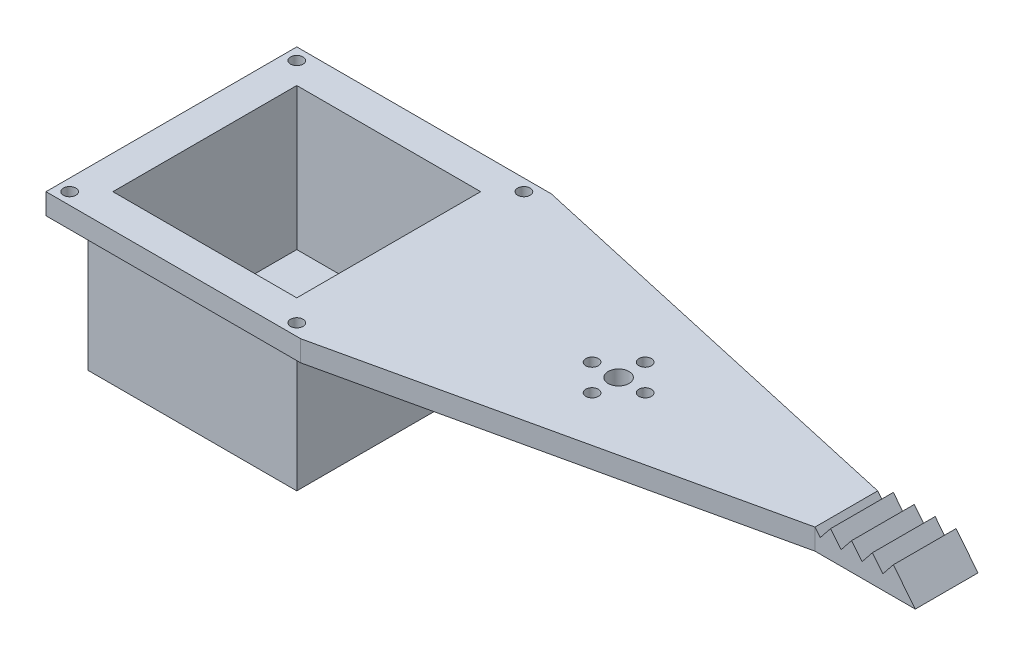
ISO-10303-21;
HEADER;
FILE_DESCRIPTION(('STEP AP214'),'2;1');
FILE_NAME('part.step','',(''),(''),'','','');
FILE_SCHEMA(('AUTOMOTIVE_DESIGN { 1 0 10303 214 1 1 1 1 }'));
ENDSEC;
DATA;
#1=APPLICATION_CONTEXT('core data for automotive mechanical design processes');
#2=APPLICATION_PROTOCOL_DEFINITION('international standard','automotive_design',2000,#1);
#3=PRODUCT_CONTEXT('',#1,'mechanical');
#4=PRODUCT('Part','Part','',(#3));
#5=PRODUCT_RELATED_PRODUCT_CATEGORY('part','',(#4));
#6=PRODUCT_DEFINITION_FORMATION('','',#4);
#7=PRODUCT_DEFINITION_CONTEXT('part definition',#1,'design');
#8=PRODUCT_DEFINITION('design','',#6,#7);
#9=PRODUCT_DEFINITION_SHAPE('','',#8);
#10=(LENGTH_UNIT() NAMED_UNIT(*) SI_UNIT(.MILLI.,.METRE.));
#11=(NAMED_UNIT(*) PLANE_ANGLE_UNIT() SI_UNIT($,.RADIAN.));
#12=(NAMED_UNIT(*) SI_UNIT($,.STERADIAN.) SOLID_ANGLE_UNIT());
#13=UNCERTAINTY_MEASURE_WITH_UNIT(LENGTH_MEASURE(1.E-05),#10,'distance_accuracy_value','');
#14=(GEOMETRIC_REPRESENTATION_CONTEXT(3) GLOBAL_UNCERTAINTY_ASSIGNED_CONTEXT((#13)) GLOBAL_UNIT_ASSIGNED_CONTEXT((#10,
#11,#12)) REPRESENTATION_CONTEXT('',''));
#15=CARTESIAN_POINT('',(0.,0.,0.));
#16=DIRECTION('',(0.,0.,1.));
#17=DIRECTION('',(1.,0.,0.));
#18=AXIS2_PLACEMENT_3D('',#15,#16,#17);
#19=CARTESIAN_POINT('',(157.736236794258,35.4387505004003,-55.01));
#20=DIRECTION('',(0.780624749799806,0.624999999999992,0.));
#21=DIRECTION('',(-0.624999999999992,0.780624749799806,0.));
#22=AXIS2_PLACEMENT_3D('',#19,#20,#21);
#23=PLANE('',#22);
#24=DIRECTION('',(0.624999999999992,-0.780624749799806,0.));
#25=VECTOR('',#24,1.);
#26=CARTESIAN_POINT('',(228.852940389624,-53.3859838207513,-32.5));
#27=LINE('',#26,#25);
#28=CARTESIAN_POINT('',(156.486236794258,37.,-32.4999999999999));
#29=VERTEX_POINT('',#28);
#30=CARTESIAN_POINT('',(157.736236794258,35.4387505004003,-32.4999999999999));
#31=VERTEX_POINT('',#30);
#32=EDGE_CURVE('E221',#29,#31,#27,.T.);
#33=ORIENTED_EDGE('',*,*,#32,.F.);
#34=DIRECTION('',(0.,0.,1.));
#35=VECTOR('',#34,1.);
#36=CARTESIAN_POINT('',(156.486236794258,37.,-32.4999999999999));
#37=LINE('',#36,#35);
#38=CARTESIAN_POINT('',(156.486236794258,37.,-17.5));
#39=VERTEX_POINT('',#38);
#40=EDGE_CURVE('E41',#29,#39,#37,.T.);
#41=ORIENTED_EDGE('',*,*,#40,.T.);
#42=DIRECTION('',(-0.624999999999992,0.780624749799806,0.));
#43=VECTOR('',#42,1.);
#44=CARTESIAN_POINT('',(228.852940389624,-53.3859838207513,-17.5));
#45=LINE('',#44,#43);
#46=CARTESIAN_POINT('',(157.736236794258,35.4387505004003,-17.5));
#47=VERTEX_POINT('',#46);
#48=EDGE_CURVE('E212',#47,#39,#45,.T.);
#49=ORIENTED_EDGE('',*,*,#48,.F.);
#50=DIRECTION('',(0.,0.,1.));
#51=VECTOR('',#50,1.);
#52=CARTESIAN_POINT('',(157.736236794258,35.4387505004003,-55.01));
#53=LINE('',#52,#51);
#54=EDGE_CURVE('E11',#31,#47,#53,.T.);
#55=ORIENTED_EDGE('',*,*,#54,.F.);
#56=EDGE_LOOP('',(#33,#41,#49,#55));
#57=FACE_BOUND('',#56,.T.);
#58=ADVANCED_FACE('F37',(#57),#23,.T.);
#59=CARTESIAN_POINT('',(158.986236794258,36.9999999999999,-55.01));
#60=DIRECTION('',(-0.780624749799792,0.625000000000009,0.));
#61=DIRECTION('',(-0.625000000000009,-0.780624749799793,0.));
#62=AXIS2_PLACEMENT_3D('',#59,#60,#61);
#63=PLANE('',#62);
#64=DIRECTION('',(0.625000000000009,0.780624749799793,0.));
#65=VECTOR('',#64,1.);
#66=CARTESIAN_POINT('',(225.497473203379,120.07250764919,-32.5));
#67=LINE('',#66,#65);
#68=CARTESIAN_POINT('',(160.236236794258,38.5612494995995,-32.4999999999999));
#69=VERTEX_POINT('',#68);
#70=EDGE_CURVE('E279',#31,#69,#67,.T.);
#71=ORIENTED_EDGE('',*,*,#70,.F.);
#72=ORIENTED_EDGE('',*,*,#54,.T.);
#73=DIRECTION('',(-0.625000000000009,-0.780624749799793,0.));
#74=VECTOR('',#73,1.);
#75=CARTESIAN_POINT('',(225.497473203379,120.07250764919,-17.5));
#76=LINE('',#75,#74);
#77=CARTESIAN_POINT('',(160.236236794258,38.5612494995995,-17.5));
#78=VERTEX_POINT('',#77);
#79=EDGE_CURVE('E215',#78,#47,#76,.T.);
#80=ORIENTED_EDGE('',*,*,#79,.F.);
#81=DIRECTION('',(0.,0.,1.));
#82=VECTOR('',#81,1.);
#83=CARTESIAN_POINT('',(160.236236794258,38.5612494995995,-55.01));
#84=LINE('',#83,#82);
#85=EDGE_CURVE('E47',#69,#78,#84,.T.);
#86=ORIENTED_EDGE('',*,*,#85,.F.);
#87=EDGE_LOOP('',(#71,#72,#80,#86));
#88=FACE_BOUND('',#87,.T.);
#89=ADVANCED_FACE('F326',(#88),#63,.T.);
#90=CARTESIAN_POINT('',(161.486236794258,36.9999999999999,-55.01));
#91=DIRECTION('',(0.780624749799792,0.625000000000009,0.));
#92=DIRECTION('',(-0.625000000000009,0.780624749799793,0.));
#93=AXIS2_PLACEMENT_3D('',#90,#91,#92);
#94=PLANE('',#93);
#95=DIRECTION('',(0.625000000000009,-0.780624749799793,0.));
#96=VECTOR('',#95,1.);
#97=CARTESIAN_POINT('',(231.899815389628,-50.9465314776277,-32.5));
#98=LINE('',#97,#96);
#99=CARTESIAN_POINT('',(162.736236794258,35.4387505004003,-32.4999999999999));
#100=VERTEX_POINT('',#99);
#101=EDGE_CURVE('E282',#69,#100,#98,.T.);
#102=ORIENTED_EDGE('',*,*,#101,.F.);
#103=ORIENTED_EDGE('',*,*,#85,.T.);
#104=DIRECTION('',(-0.625000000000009,0.780624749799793,0.));
#105=VECTOR('',#104,1.);
#106=CARTESIAN_POINT('',(231.899815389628,-50.9465314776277,-17.5));
#107=LINE('',#106,#105);
#108=CARTESIAN_POINT('',(162.736236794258,35.4387505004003,-17.5));
#109=VERTEX_POINT('',#108);
#110=EDGE_CURVE('E259',#109,#78,#107,.T.);
#111=ORIENTED_EDGE('',*,*,#110,.F.);
#112=DIRECTION('',(0.,0.,1.));
#113=VECTOR('',#112,1.);
#114=CARTESIAN_POINT('',(162.736236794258,35.4387505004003,-55.01));
#115=LINE('',#114,#113);
#116=EDGE_CURVE('E247',#100,#109,#115,.T.);
#117=ORIENTED_EDGE('',*,*,#116,.F.);
#118=EDGE_LOOP('',(#102,#103,#111,#117));
#119=FACE_BOUND('',#118,.T.);
#120=ADVANCED_FACE('F323',(#119),#94,.T.);
#121=CARTESIAN_POINT('',(163.986236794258,36.9999999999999,-55.01));
#122=DIRECTION('',(-0.780624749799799,0.625000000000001,0.));
#123=DIRECTION('',(-0.625000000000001,-0.780624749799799,0.));
#124=AXIS2_PLACEMENT_3D('',#121,#122,#123);
#125=PLANE('',#124);
#126=DIRECTION('',(0.625000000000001,0.780624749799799,0.));
#127=VECTOR('',#126,1.);
#128=CARTESIAN_POINT('',(228.544348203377,117.633055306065,-32.5));
#129=LINE('',#128,#127);
#130=CARTESIAN_POINT('',(165.236236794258,38.5612494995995,-32.4999999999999));
#131=VERTEX_POINT('',#130);
#132=EDGE_CURVE('E285',#100,#131,#129,.T.);
#133=ORIENTED_EDGE('',*,*,#132,.F.);
#134=ORIENTED_EDGE('',*,*,#116,.T.);
#135=DIRECTION('',(-0.625000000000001,-0.780624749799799,0.));
#136=VECTOR('',#135,1.);
#137=CARTESIAN_POINT('',(228.544348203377,117.633055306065,-17.5));
#138=LINE('',#137,#136);
#139=CARTESIAN_POINT('',(165.236236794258,38.5612494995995,-17.5));
#140=VERTEX_POINT('',#139);
#141=EDGE_CURVE('E261',#140,#109,#138,.T.);
#142=ORIENTED_EDGE('',*,*,#141,.F.);
#143=DIRECTION('',(0.,0.,1.));
#144=VECTOR('',#143,1.);
#145=CARTESIAN_POINT('',(165.236236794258,38.5612494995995,-55.01));
#146=LINE('',#145,#144);
#147=EDGE_CURVE('E249',#131,#140,#146,.T.);
#148=ORIENTED_EDGE('',*,*,#147,.F.);
#149=EDGE_LOOP('',(#133,#134,#142,#148));
#150=FACE_BOUND('',#149,.T.);
#151=ADVANCED_FACE('F320',(#150),#125,.T.);
#152=CARTESIAN_POINT('',(166.486236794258,37.,-55.01));
#153=DIRECTION('',(0.780624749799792,0.625000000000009,0.));
#154=DIRECTION('',(-0.625000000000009,0.780624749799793,0.));
#155=AXIS2_PLACEMENT_3D('',#152,#153,#154);
#156=PLANE('',#155);
#157=DIRECTION('',(0.625000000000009,-0.780624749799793,0.));
#158=VECTOR('',#157,1.);
#159=CARTESIAN_POINT('',(234.946690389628,-48.5070791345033,-32.5));
#160=LINE('',#159,#158);
#161=CARTESIAN_POINT('',(167.736236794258,35.4387505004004,-32.4999999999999));
#162=VERTEX_POINT('',#161);
#163=EDGE_CURVE('E288',#131,#162,#160,.T.);
#164=ORIENTED_EDGE('',*,*,#163,.F.);
#165=ORIENTED_EDGE('',*,*,#147,.T.);
#166=DIRECTION('',(-0.625000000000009,0.780624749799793,0.));
#167=VECTOR('',#166,1.);
#168=CARTESIAN_POINT('',(234.946690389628,-48.5070791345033,-17.5));
#169=LINE('',#168,#167);
#170=CARTESIAN_POINT('',(167.736236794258,35.4387505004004,-17.5));
#171=VERTEX_POINT('',#170);
#172=EDGE_CURVE('E264',#171,#140,#169,.T.);
#173=ORIENTED_EDGE('',*,*,#172,.F.);
#174=DIRECTION('',(0.,0.,1.));
#175=VECTOR('',#174,1.);
#176=CARTESIAN_POINT('',(167.736236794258,35.4387505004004,-55.01));
#177=LINE('',#176,#175);
#178=EDGE_CURVE('E251',#162,#171,#177,.T.);
#179=ORIENTED_EDGE('',*,*,#178,.F.);
#180=EDGE_LOOP('',(#164,#165,#173,#179));
#181=FACE_BOUND('',#180,.T.);
#182=ADVANCED_FACE('F315',(#181),#156,.T.);
#183=CARTESIAN_POINT('',(168.986236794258,37.,-55.01));
#184=DIRECTION('',(-0.780624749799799,0.625000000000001,0.));
#185=DIRECTION('',(-0.625000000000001,-0.780624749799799,0.));
#186=AXIS2_PLACEMENT_3D('',#183,#184,#185);
#187=PLANE('',#186);
#188=DIRECTION('',(0.625000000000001,0.780624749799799,0.));
#189=VECTOR('',#188,1.);
#190=CARTESIAN_POINT('',(231.591223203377,115.193602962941,-32.5));
#191=LINE('',#190,#189);
#192=CARTESIAN_POINT('',(170.236236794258,38.5612494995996,-32.4999999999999));
#193=VERTEX_POINT('',#192);
#194=EDGE_CURVE('E291',#162,#193,#191,.T.);
#195=ORIENTED_EDGE('',*,*,#194,.F.);
#196=ORIENTED_EDGE('',*,*,#178,.T.);
#197=DIRECTION('',(-0.625000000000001,-0.780624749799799,0.));
#198=VECTOR('',#197,1.);
#199=CARTESIAN_POINT('',(231.591223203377,115.193602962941,-17.5));
#200=LINE('',#199,#198);
#201=CARTESIAN_POINT('',(170.236236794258,38.5612494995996,-17.5));
#202=VERTEX_POINT('',#201);
#203=EDGE_CURVE('E267',#202,#171,#200,.T.);
#204=ORIENTED_EDGE('',*,*,#203,.F.);
#205=DIRECTION('',(0.,0.,1.));
#206=VECTOR('',#205,1.);
#207=CARTESIAN_POINT('',(170.236236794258,38.5612494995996,-55.01));
#208=LINE('',#207,#206);
#209=EDGE_CURVE('E253',#193,#202,#208,.T.);
#210=ORIENTED_EDGE('',*,*,#209,.F.);
#211=EDGE_LOOP('',(#195,#196,#204,#210));
#212=FACE_BOUND('',#211,.T.);
#213=ADVANCED_FACE('F311',(#212),#187,.T.);
#214=CARTESIAN_POINT('',(171.486236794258,37.,-55.01));
#215=DIRECTION('',(0.780624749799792,0.625000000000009,0.));
#216=DIRECTION('',(-0.625000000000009,0.780624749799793,0.));
#217=AXIS2_PLACEMENT_3D('',#214,#215,#216);
#218=PLANE('',#217);
#219=DIRECTION('',(0.625000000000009,-0.780624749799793,0.));
#220=VECTOR('',#219,1.);
#221=CARTESIAN_POINT('',(237.993565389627,-46.0676267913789,-32.5));
#222=LINE('',#221,#220);
#223=CARTESIAN_POINT('',(172.736236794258,35.4387505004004,-32.4999999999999));
#224=VERTEX_POINT('',#223);
#225=EDGE_CURVE('E294',#193,#224,#222,.T.);
#226=ORIENTED_EDGE('',*,*,#225,.F.);
#227=ORIENTED_EDGE('',*,*,#209,.T.);
#228=DIRECTION('',(-0.625000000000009,0.780624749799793,0.));
#229=VECTOR('',#228,1.);
#230=CARTESIAN_POINT('',(237.993565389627,-46.0676267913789,-17.5));
#231=LINE('',#230,#229);
#232=CARTESIAN_POINT('',(172.736236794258,35.4387505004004,-17.5));
#233=VERTEX_POINT('',#232);
#234=EDGE_CURVE('E270',#233,#202,#231,.T.);
#235=ORIENTED_EDGE('',*,*,#234,.F.);
#236=DIRECTION('',(0.,0.,1.));
#237=VECTOR('',#236,1.);
#238=CARTESIAN_POINT('',(172.736236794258,35.4387505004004,-55.01));
#239=LINE('',#238,#237);
#240=EDGE_CURVE('E255',#224,#233,#239,.T.);
#241=ORIENTED_EDGE('',*,*,#240,.F.);
#242=EDGE_LOOP('',(#226,#227,#235,#241));
#243=FACE_BOUND('',#242,.T.);
#244=ADVANCED_FACE('F308',(#243),#218,.T.);
#245=CARTESIAN_POINT('',(173.986236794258,37.,-55.01));
#246=DIRECTION('',(-0.780624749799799,0.625000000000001,0.));
#247=DIRECTION('',(-0.625000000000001,-0.780624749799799,0.));
#248=AXIS2_PLACEMENT_3D('',#245,#246,#247);
#249=PLANE('',#248);
#250=DIRECTION('',(0.625000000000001,0.780624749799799,0.));
#251=VECTOR('',#250,1.);
#252=CARTESIAN_POINT('',(234.638098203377,112.754150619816,-32.5));
#253=LINE('',#252,#251);
#254=CARTESIAN_POINT('',(175.236236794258,38.5612494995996,-32.4999999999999));
#255=VERTEX_POINT('',#254);
#256=EDGE_CURVE('E230',#224,#255,#253,.T.);
#257=ORIENTED_EDGE('',*,*,#256,.F.);
#258=ORIENTED_EDGE('',*,*,#240,.T.);
#259=DIRECTION('',(-0.625000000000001,-0.780624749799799,0.));
#260=VECTOR('',#259,1.);
#261=CARTESIAN_POINT('',(234.638098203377,112.754150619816,-17.5));
#262=LINE('',#261,#260);
#263=CARTESIAN_POINT('',(175.236236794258,38.5612494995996,-17.5));
#264=VERTEX_POINT('',#263);
#265=EDGE_CURVE('E273',#264,#233,#262,.T.);
#266=ORIENTED_EDGE('',*,*,#265,.F.);
#267=DIRECTION('',(0.,0.,1.));
#268=VECTOR('',#267,1.);
#269=CARTESIAN_POINT('',(175.236236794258,38.5612494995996,-55.01));
#270=LINE('',#269,#268);
#271=EDGE_CURVE('E195',#255,#264,#270,.T.);
#272=ORIENTED_EDGE('',*,*,#271,.F.);
#273=EDGE_LOOP('',(#257,#258,#266,#272));
#274=FACE_BOUND('',#273,.T.);
#275=ADVANCED_FACE('F304',(#274),#249,.T.);
#276=CARTESIAN_POINT('',(176.486236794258,37.,-55.01));
#277=DIRECTION('',(0.780624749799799,0.625000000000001,0.));
#278=DIRECTION('',(-0.625000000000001,0.780624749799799,0.));
#279=AXIS2_PLACEMENT_3D('',#276,#277,#278);
#280=PLANE('',#279);
#281=DIRECTION('',(0.625000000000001,-0.780624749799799,0.));
#282=VECTOR('',#281,1.);
#283=CARTESIAN_POINT('',(241.040440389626,-43.6281744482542,-32.5));
#284=LINE('',#283,#282);
#285=CARTESIAN_POINT('',(180.489440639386,32.,-32.4999999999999));
#286=VERTEX_POINT('',#285);
#287=EDGE_CURVE('E224',#255,#286,#284,.T.);
#288=ORIENTED_EDGE('',*,*,#287,.F.);
#289=ORIENTED_EDGE('',*,*,#271,.T.);
#290=DIRECTION('',(-0.625000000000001,0.780624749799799,0.));
#291=VECTOR('',#290,1.);
#292=CARTESIAN_POINT('',(241.040440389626,-43.6281744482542,-17.5));
#293=LINE('',#292,#291);
#294=CARTESIAN_POINT('',(180.489440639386,32.,-17.5));
#295=VERTEX_POINT('',#294);
#296=EDGE_CURVE('E276',#295,#264,#293,.T.);
#297=ORIENTED_EDGE('',*,*,#296,.F.);
#298=DIRECTION('',(0.,0.,-1.));
#299=VECTOR('',#298,1.);
#300=CARTESIAN_POINT('',(180.489440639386,32.,0.));
#301=LINE('',#300,#299);
#302=EDGE_CURVE('E222',#295,#286,#301,.T.);
#303=ORIENTED_EDGE('',*,*,#302,.T.);
#304=EDGE_LOOP('',(#288,#289,#297,#303));
#305=FACE_BOUND('',#304,.T.);
#306=ADVANCED_FACE('F302',(#305),#280,.T.);
#307=CARTESIAN_POINT('',(0.,32.,0.));
#308=DIRECTION('',(0.,1.,0.));
#309=DIRECTION('',(0.,0.,1.));
#310=AXIS2_PLACEMENT_3D('',#307,#308,#309);
#311=PLANE('',#310);
#312=CARTESIAN_POINT('',(-2.17157287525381,32.,-52.1715728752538));
#313=DIRECTION('',(0.,1.,0.));
#314=DIRECTION('',(0.,0.,1.));
#315=AXIS2_PLACEMENT_3D('',#312,#313,#314);
#316=CIRCLE('',#315,1.5);
#317=CARTESIAN_POINT('',(-2.17157287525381,32.,-50.6715728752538));
#318=VERTEX_POINT('',#317);
#319=EDGE_CURVE('E341',#318,#318,#316,.F.);
#320=ORIENTED_EDGE('',*,*,#319,.F.);
#321=EDGE_LOOP('',(#320));
#322=FACE_BOUND('',#321,.T.);
#323=CARTESIAN_POINT('',(52.1715728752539,32.,-52.1715728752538));
#324=DIRECTION('',(0.,1.,0.));
#325=DIRECTION('',(0.,0.,1.));
#326=AXIS2_PLACEMENT_3D('',#323,#324,#325);
#327=CIRCLE('',#326,1.50000000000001);
#328=CARTESIAN_POINT('',(52.1715728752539,32.,-50.6715728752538));
#329=VERTEX_POINT('',#328);
#330=EDGE_CURVE('E360',#329,#329,#327,.F.);
#331=ORIENTED_EDGE('',*,*,#330,.F.);
#332=EDGE_LOOP('',(#331));
#333=FACE_BOUND('',#332,.T.);
#334=CARTESIAN_POINT('',(52.1715728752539,32.,2.17157287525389));
#335=DIRECTION('',(0.,1.,0.));
#336=DIRECTION('',(0.,0.,1.));
#337=AXIS2_PLACEMENT_3D('',#334,#335,#336);
#338=CIRCLE('',#337,1.5);
#339=CARTESIAN_POINT('',(52.1715728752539,32.,3.6715728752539));
#340=VERTEX_POINT('',#339);
#341=EDGE_CURVE('E368',#340,#340,#338,.F.);
#342=ORIENTED_EDGE('',*,*,#341,.F.);
#343=EDGE_LOOP('',(#342));
#344=FACE_BOUND('',#343,.T.);
#345=CARTESIAN_POINT('',(-2.17157287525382,32.,2.1715728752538));
#346=DIRECTION('',(0.,1.,0.));
#347=DIRECTION('',(0.,0.,1.));
#348=AXIS2_PLACEMENT_3D('',#345,#346,#347);
#349=CIRCLE('',#348,1.5);
#350=CARTESIAN_POINT('',(-2.17157287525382,32.,3.6715728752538));
#351=VERTEX_POINT('',#350);
#352=EDGE_CURVE('E361',#351,#351,#349,.F.);
#353=ORIENTED_EDGE('',*,*,#352,.F.);
#354=EDGE_LOOP('',(#353));
#355=FACE_BOUND('',#354,.T.);
#356=DIRECTION('',(0.,0.,-1.));
#357=VECTOR('',#356,1.);
#358=CARTESIAN_POINT('',(50.,32.,0.));
#359=LINE('',#358,#357);
#360=CARTESIAN_POINT('',(50.,32.,0.));
#361=VERTEX_POINT('',#360);
#362=CARTESIAN_POINT('',(50.,32.,-50.));
#363=VERTEX_POINT('',#362);
#364=EDGE_CURVE('E465',#361,#363,#359,.T.);
#365=ORIENTED_EDGE('',*,*,#364,.T.);
#366=DIRECTION('',(-1.,0.,0.));
#367=VECTOR('',#366,1.);
#368=CARTESIAN_POINT('',(0.,32.,-50.));
#369=LINE('',#368,#367);
#370=CARTESIAN_POINT('',(0.,32.,-50.));
#371=VERTEX_POINT('',#370);
#372=EDGE_CURVE('E467',#363,#371,#369,.T.);
#373=ORIENTED_EDGE('',*,*,#372,.T.);
#374=DIRECTION('',(0.,0.,1.));
#375=VECTOR('',#374,1.);
#376=CARTESIAN_POINT('',(0.,32.,0.));
#377=LINE('',#376,#375);
#378=CARTESIAN_POINT('',(0.,32.,0.));
#379=VERTEX_POINT('',#378);
#380=EDGE_CURVE('E452',#371,#379,#377,.T.);
#381=ORIENTED_EDGE('',*,*,#380,.T.);
#382=DIRECTION('',(1.,0.,0.));
#383=VECTOR('',#382,1.);
#384=CARTESIAN_POINT('',(0.,32.,0.));
#385=LINE('',#384,#383);
#386=EDGE_CURVE('E462',#379,#361,#385,.T.);
#387=ORIENTED_EDGE('',*,*,#386,.T.);
#388=EDGE_LOOP('',(#365,#373,#381,#387));
#389=FACE_BOUND('',#388,.T.);
#390=CARTESIAN_POINT('',(108.35,32.,-25.));
#391=DIRECTION('',(0.,1.,0.));
#392=DIRECTION('',(0.,0.,1.));
#393=AXIS2_PLACEMENT_3D('',#390,#391,#392);
#394=CIRCLE('',#393,1.5);
#395=CARTESIAN_POINT('',(108.35,32.,-23.5));
#396=VERTEX_POINT('',#395);
#397=EDGE_CURVE('E395',#396,#396,#394,.T.);
#398=ORIENTED_EDGE('',*,*,#397,.T.);
#399=EDGE_LOOP('',(#398));
#400=FACE_BOUND('',#399,.T.);
#401=CARTESIAN_POINT('',(102.,32.,-18.65));
#402=DIRECTION('',(0.,1.,0.));
#403=DIRECTION('',(0.,0.,1.));
#404=AXIS2_PLACEMENT_3D('',#401,#402,#403);
#405=CIRCLE('',#404,1.5);
#406=CARTESIAN_POINT('',(102.,32.,-17.15));
#407=VERTEX_POINT('',#406);
#408=EDGE_CURVE('E399',#407,#407,#405,.T.);
#409=ORIENTED_EDGE('',*,*,#408,.T.);
#410=EDGE_LOOP('',(#409));
#411=FACE_BOUND('',#410,.T.);
#412=CARTESIAN_POINT('',(95.65,32.,-25.));
#413=DIRECTION('',(0.,1.,0.));
#414=DIRECTION('',(0.,0.,1.));
#415=AXIS2_PLACEMENT_3D('',#412,#413,#414);
#416=CIRCLE('',#415,1.5);
#417=CARTESIAN_POINT('',(95.65,32.,-23.5));
#418=VERTEX_POINT('',#417);
#419=EDGE_CURVE('E404',#418,#418,#416,.T.);
#420=ORIENTED_EDGE('',*,*,#419,.T.);
#421=EDGE_LOOP('',(#420));
#422=FACE_BOUND('',#421,.T.);
#423=CARTESIAN_POINT('',(102.,32.,-25.));
#424=DIRECTION('',(0.,1.,0.));
#425=DIRECTION('',(0.,0.,1.));
#426=AXIS2_PLACEMENT_3D('',#423,#424,#425);
#427=CIRCLE('',#426,2.5);
#428=CARTESIAN_POINT('',(102.,32.,-22.5));
#429=VERTEX_POINT('',#428);
#430=EDGE_CURVE('E614',#429,#429,#427,.T.);
#431=ORIENTED_EDGE('',*,*,#430,.T.);
#432=EDGE_LOOP('',(#431));
#433=FACE_BOUND('',#432,.T.);
#434=CARTESIAN_POINT('',(102.,32.,-31.35));
#435=DIRECTION('',(0.,1.,0.));
#436=DIRECTION('',(0.,0.,1.));
#437=AXIS2_PLACEMENT_3D('',#434,#435,#436);
#438=CIRCLE('',#437,1.5);
#439=CARTESIAN_POINT('',(102.,32.,-29.85));
#440=VERTEX_POINT('',#439);
#441=EDGE_CURVE('E380',#440,#440,#438,.T.);
#442=ORIENTED_EDGE('',*,*,#441,.T.);
#443=EDGE_LOOP('',(#442));
#444=FACE_BOUND('',#443,.T.);
#445=ORIENTED_EDGE('',*,*,#302,.F.);
#446=DIRECTION('',(1.,0.,0.));
#447=VECTOR('',#446,1.);
#448=CARTESIAN_POINT('',(335.5,32.,-17.5));
#449=LINE('',#448,#447);
#450=CARTESIAN_POINT('',(156.486236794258,32.,-17.5));
#451=VERTEX_POINT('',#450);
#452=EDGE_CURVE('E234',#451,#295,#449,.T.);
#453=ORIENTED_EDGE('',*,*,#452,.F.);
#454=DIRECTION('',(-0.975882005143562,0.,0.218298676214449));
#455=VECTOR('',#454,1.);
#456=CARTESIAN_POINT('',(3.7291533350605,32.,16.6708002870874));
#457=LINE('',#456,#455);
#458=CARTESIAN_POINT('',(55.9022777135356,32.,5.));
#459=VERTEX_POINT('',#458);
#460=EDGE_CURVE('E203',#451,#459,#457,.T.);
#461=ORIENTED_EDGE('',*,*,#460,.T.);
#462=DIRECTION('',(1.,0.,0.));
#463=VECTOR('',#462,1.);
#464=CARTESIAN_POINT('',(-5.,32.,5.));
#465=LINE('',#464,#463);
#466=CARTESIAN_POINT('',(-5.,32.,5.));
#467=VERTEX_POINT('',#466);
#468=EDGE_CURVE('E350',#467,#459,#465,.T.);
#469=ORIENTED_EDGE('',*,*,#468,.F.);
#470=DIRECTION('',(0.,0.,1.));
#471=VECTOR('',#470,1.);
#472=CARTESIAN_POINT('',(-5.,32.,-55.));
#473=LINE('',#472,#471);
#474=CARTESIAN_POINT('',(-5.,32.,-55.));
#475=VERTEX_POINT('',#474);
#476=EDGE_CURVE('E353',#475,#467,#473,.T.);
#477=ORIENTED_EDGE('',*,*,#476,.F.);
#478=DIRECTION('',(-1.,0.,0.));
#479=VECTOR('',#478,1.);
#480=CARTESIAN_POINT('',(55.,32.,-55.));
#481=LINE('',#480,#479);
#482=CARTESIAN_POINT('',(55.9022777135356,32.,-55.));
#483=VERTEX_POINT('',#482);
#484=EDGE_CURVE('E356',#483,#475,#481,.T.);
#485=ORIENTED_EDGE('',*,*,#484,.F.);
#486=DIRECTION('',(0.975882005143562,0.,0.21829867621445));
#487=VECTOR('',#486,1.);
#488=CARTESIAN_POINT('',(14.3808408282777,32.,-64.2880846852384));
#489=LINE('',#488,#487);
#490=CARTESIAN_POINT('',(156.486236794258,32.,-32.4999999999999));
#491=VERTEX_POINT('',#490);
#492=EDGE_CURVE('E235',#483,#491,#489,.T.);
#493=ORIENTED_EDGE('',*,*,#492,.T.);
#494=DIRECTION('',(-1.,0.,0.));
#495=VECTOR('',#494,1.);
#496=CARTESIAN_POINT('',(335.5,32.,-32.5));
#497=LINE('',#496,#495);
#498=EDGE_CURVE('E207',#286,#491,#497,.T.);
#499=ORIENTED_EDGE('',*,*,#498,.F.);
#500=EDGE_LOOP('',(#445,#453,#461,#469,#477,#485,#493,#499));
#501=FACE_BOUND('',#500,.T.);
#502=ADVANCED_FACE('F478',(#322,#333,#344,#355,#389,#400,#411,#422,#433,#444,#501),#311,.F.);
#503=CARTESIAN_POINT('',(335.5,32.,-32.5));
#504=DIRECTION('',(0.,0.,-1.));
#505=DIRECTION('',(-1.,0.,0.));
#506=AXIS2_PLACEMENT_3D('',#503,#504,#505);
#507=PLANE('',#506);
#508=ORIENTED_EDGE('',*,*,#256,.T.);
#509=ORIENTED_EDGE('',*,*,#287,.T.);
#510=ORIENTED_EDGE('',*,*,#498,.T.);
#511=DIRECTION('',(0.,1.,0.));
#512=VECTOR('',#511,1.);
#513=CARTESIAN_POINT('',(156.486236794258,32.,-32.4999999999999));
#514=LINE('',#513,#512);
#515=EDGE_CURVE('E208',#491,#29,#514,.T.);
#516=ORIENTED_EDGE('',*,*,#515,.T.);
#517=ORIENTED_EDGE('',*,*,#32,.T.);
#518=ORIENTED_EDGE('',*,*,#70,.T.);
#519=ORIENTED_EDGE('',*,*,#101,.T.);
#520=ORIENTED_EDGE('',*,*,#132,.T.);
#521=ORIENTED_EDGE('',*,*,#163,.T.);
#522=ORIENTED_EDGE('',*,*,#194,.T.);
#523=ORIENTED_EDGE('',*,*,#225,.T.);
#524=EDGE_LOOP('',(#508,#509,#510,#516,#517,#518,#519,#520,#521,#522,#523));
#525=FACE_BOUND('',#524,.T.);
#526=ADVANCED_FACE('F299',(#525),#507,.T.);
#527=CARTESIAN_POINT('',(335.5,32.,-17.5));
#528=DIRECTION('',(0.,0.,1.));
#529=DIRECTION('',(1.,0.,0.));
#530=AXIS2_PLACEMENT_3D('',#527,#528,#529);
#531=PLANE('',#530);
#532=ORIENTED_EDGE('',*,*,#452,.T.);
#533=ORIENTED_EDGE('',*,*,#296,.T.);
#534=ORIENTED_EDGE('',*,*,#265,.T.);
#535=ORIENTED_EDGE('',*,*,#234,.T.);
#536=ORIENTED_EDGE('',*,*,#203,.T.);
#537=ORIENTED_EDGE('',*,*,#172,.T.);
#538=ORIENTED_EDGE('',*,*,#141,.T.);
#539=ORIENTED_EDGE('',*,*,#110,.T.);
#540=ORIENTED_EDGE('',*,*,#79,.T.);
#541=ORIENTED_EDGE('',*,*,#48,.T.);
#542=DIRECTION('',(0.,1.,0.));
#543=VECTOR('',#542,1.);
#544=CARTESIAN_POINT('',(156.486236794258,32.,-17.5));
#545=LINE('',#544,#543);
#546=EDGE_CURVE('E199',#451,#39,#545,.T.);
#547=ORIENTED_EDGE('',*,*,#546,.F.);
#548=EDGE_LOOP('',(#532,#533,#534,#535,#536,#537,#538,#539,#540,#541,#547));
#549=FACE_BOUND('',#548,.T.);
#550=ADVANCED_FACE('F39',(#549),#531,.T.);
#551=CARTESIAN_POINT('',(0.,37.,0.));
#552=DIRECTION('',(0.,-1.,0.));
#553=DIRECTION('',(0.,0.,-1.));
#554=AXIS2_PLACEMENT_3D('',#551,#552,#553);
#555=PLANE('',#554);
#556=CARTESIAN_POINT('',(102.,37.,-31.35));
#557=DIRECTION('',(0.,1.,0.));
#558=DIRECTION('',(0.,0.,1.));
#559=AXIS2_PLACEMENT_3D('',#556,#557,#558);
#560=CIRCLE('',#559,1.5);
#561=CARTESIAN_POINT('',(102.,37.,-29.85));
#562=VERTEX_POINT('',#561);
#563=EDGE_CURVE('E389',#562,#562,#560,.T.);
#564=ORIENTED_EDGE('',*,*,#563,.F.);
#565=EDGE_LOOP('',(#564));
#566=FACE_BOUND('',#565,.T.);
#567=CARTESIAN_POINT('',(102.,37.,-25.));
#568=DIRECTION('',(0.,1.,0.));
#569=DIRECTION('',(0.,0.,1.));
#570=AXIS2_PLACEMENT_3D('',#567,#568,#569);
#571=CIRCLE('',#570,2.5);
#572=CARTESIAN_POINT('',(102.,37.,-22.5));
#573=VERTEX_POINT('',#572);
#574=EDGE_CURVE('E329',#573,#573,#571,.T.);
#575=ORIENTED_EDGE('',*,*,#574,.F.);
#576=EDGE_LOOP('',(#575));
#577=FACE_BOUND('',#576,.T.);
#578=CARTESIAN_POINT('',(95.65,37.,-25.));
#579=DIRECTION('',(0.,1.,0.));
#580=DIRECTION('',(0.,0.,1.));
#581=AXIS2_PLACEMENT_3D('',#578,#579,#580);
#582=CIRCLE('',#581,1.5);
#583=CARTESIAN_POINT('',(95.65,37.,-23.5));
#584=VERTEX_POINT('',#583);
#585=EDGE_CURVE('E385',#584,#584,#582,.T.);
#586=ORIENTED_EDGE('',*,*,#585,.F.);
#587=EDGE_LOOP('',(#586));
#588=FACE_BOUND('',#587,.T.);
#589=CARTESIAN_POINT('',(102.,37.,-18.65));
#590=DIRECTION('',(0.,1.,0.));
#591=DIRECTION('',(0.,0.,1.));
#592=AXIS2_PLACEMENT_3D('',#589,#590,#591);
#593=CIRCLE('',#592,1.5);
#594=CARTESIAN_POINT('',(102.,37.,-17.15));
#595=VERTEX_POINT('',#594);
#596=EDGE_CURVE('E382',#595,#595,#593,.T.);
#597=ORIENTED_EDGE('',*,*,#596,.F.);
#598=EDGE_LOOP('',(#597));
#599=FACE_BOUND('',#598,.T.);
#600=CARTESIAN_POINT('',(108.35,37.,-25.));
#601=DIRECTION('',(0.,1.,0.));
#602=DIRECTION('',(0.,0.,1.));
#603=AXIS2_PLACEMENT_3D('',#600,#601,#602);
#604=CIRCLE('',#603,1.5);
#605=CARTESIAN_POINT('',(108.35,37.,-23.5));
#606=VERTEX_POINT('',#605);
#607=EDGE_CURVE('E386',#606,#606,#604,.T.);
#608=ORIENTED_EDGE('',*,*,#607,.F.);
#609=EDGE_LOOP('',(#608));
#610=FACE_BOUND('',#609,.T.);
#611=DIRECTION('',(-1.,0.,0.));
#612=VECTOR('',#611,1.);
#613=CARTESIAN_POINT('',(47.,37.,-47.));
#614=LINE('',#613,#612);
#615=CARTESIAN_POINT('',(47.,37.,-47.));
#616=VERTEX_POINT('',#615);
#617=CARTESIAN_POINT('',(3.,37.,-47.));
#618=VERTEX_POINT('',#617);
#619=EDGE_CURVE('E449',#616,#618,#614,.T.);
#620=ORIENTED_EDGE('',*,*,#619,.F.);
#621=DIRECTION('',(0.,0.,-1.));
#622=VECTOR('',#621,1.);
#623=CARTESIAN_POINT('',(47.,37.,-3.));
#624=LINE('',#623,#622);
#625=CARTESIAN_POINT('',(47.,37.,-3.));
#626=VERTEX_POINT('',#625);
#627=EDGE_CURVE('E448',#626,#616,#624,.T.);
#628=ORIENTED_EDGE('',*,*,#627,.F.);
#629=DIRECTION('',(1.,0.,0.));
#630=VECTOR('',#629,1.);
#631=CARTESIAN_POINT('',(3.,37.,-3.));
#632=LINE('',#631,#630);
#633=CARTESIAN_POINT('',(3.,37.,-3.));
#634=VERTEX_POINT('',#633);
#635=EDGE_CURVE('E456',#634,#626,#632,.T.);
#636=ORIENTED_EDGE('',*,*,#635,.F.);
#637=DIRECTION('',(0.,0.,1.));
#638=VECTOR('',#637,1.);
#639=CARTESIAN_POINT('',(3.,37.,-47.));
#640=LINE('',#639,#638);
#641=EDGE_CURVE('E453',#618,#634,#640,.T.);
#642=ORIENTED_EDGE('',*,*,#641,.F.);
#643=EDGE_LOOP('',(#620,#628,#636,#642));
#644=FACE_BOUND('',#643,.T.);
#645=CARTESIAN_POINT('',(-2.17157287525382,37.,2.1715728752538));
#646=DIRECTION('',(0.,1.,0.));
#647=DIRECTION('',(0.,0.,1.));
#648=AXIS2_PLACEMENT_3D('',#645,#646,#647);
#649=CIRCLE('',#648,1.5);
#650=CARTESIAN_POINT('',(-2.17157287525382,37.,3.6715728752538));
#651=VERTEX_POINT('',#650);
#652=EDGE_CURVE('E364',#651,#651,#649,.T.);
#653=ORIENTED_EDGE('',*,*,#652,.F.);
#654=EDGE_LOOP('',(#653));
#655=FACE_BOUND('',#654,.T.);
#656=CARTESIAN_POINT('',(52.1715728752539,37.,2.17157287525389));
#657=DIRECTION('',(0.,1.,0.));
#658=DIRECTION('',(0.,0.,1.));
#659=AXIS2_PLACEMENT_3D('',#656,#657,#658);
#660=CIRCLE('',#659,1.5);
#661=CARTESIAN_POINT('',(52.1715728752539,37.,3.6715728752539));
#662=VERTEX_POINT('',#661);
#663=EDGE_CURVE('E365',#662,#662,#660,.T.);
#664=ORIENTED_EDGE('',*,*,#663,.F.);
#665=EDGE_LOOP('',(#664));
#666=FACE_BOUND('',#665,.T.);
#667=CARTESIAN_POINT('',(52.1715728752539,37.,-52.1715728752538));
#668=DIRECTION('',(0.,1.,0.));
#669=DIRECTION('',(0.,0.,1.));
#670=AXIS2_PLACEMENT_3D('',#667,#668,#669);
#671=CIRCLE('',#670,1.50000000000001);
#672=CARTESIAN_POINT('',(52.1715728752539,37.,-50.6715728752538));
#673=VERTEX_POINT('',#672);
#674=EDGE_CURVE('E371',#673,#673,#671,.T.);
#675=ORIENTED_EDGE('',*,*,#674,.F.);
#676=EDGE_LOOP('',(#675));
#677=FACE_BOUND('',#676,.T.);
#678=CARTESIAN_POINT('',(-2.17157287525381,37.,-52.1715728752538));
#679=DIRECTION('',(0.,1.,0.));
#680=DIRECTION('',(0.,0.,1.));
#681=AXIS2_PLACEMENT_3D('',#678,#679,#680);
#682=CIRCLE('',#681,1.5);
#683=CARTESIAN_POINT('',(-2.17157287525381,37.,-50.6715728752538));
#684=VERTEX_POINT('',#683);
#685=EDGE_CURVE('E345',#684,#684,#682,.T.);
#686=ORIENTED_EDGE('',*,*,#685,.F.);
#687=EDGE_LOOP('',(#686));
#688=FACE_BOUND('',#687,.T.);
#689=ORIENTED_EDGE('',*,*,#40,.F.);
#690=DIRECTION('',(0.975882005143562,0.,0.21829867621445));
#691=VECTOR('',#690,1.);
#692=CARTESIAN_POINT('',(55.9022777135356,37.,-55.));
#693=LINE('',#692,#691);
#694=CARTESIAN_POINT('',(55.9022777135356,37.,-55.));
#695=VERTEX_POINT('',#694);
#696=EDGE_CURVE('E196',#695,#29,#693,.T.);
#697=ORIENTED_EDGE('',*,*,#696,.F.);
#698=DIRECTION('',(-1.,0.,0.));
#699=VECTOR('',#698,1.);
#700=CARTESIAN_POINT('',(55.,37.,-55.));
#701=LINE('',#700,#699);
#702=CARTESIAN_POINT('',(-5.,37.,-55.));
#703=VERTEX_POINT('',#702);
#704=EDGE_CURVE('E335',#695,#703,#701,.T.);
#705=ORIENTED_EDGE('',*,*,#704,.T.);
#706=DIRECTION('',(0.,0.,1.));
#707=VECTOR('',#706,1.);
#708=CARTESIAN_POINT('',(-5.,37.,-55.));
#709=LINE('',#708,#707);
#710=CARTESIAN_POINT('',(-5.,37.,5.));
#711=VERTEX_POINT('',#710);
#712=EDGE_CURVE('E342',#703,#711,#709,.T.);
#713=ORIENTED_EDGE('',*,*,#712,.T.);
#714=DIRECTION('',(1.,0.,0.));
#715=VECTOR('',#714,1.);
#716=CARTESIAN_POINT('',(-5.,37.,5.));
#717=LINE('',#716,#715);
#718=CARTESIAN_POINT('',(55.9022777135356,37.,5.));
#719=VERTEX_POINT('',#718);
#720=EDGE_CURVE('E193',#711,#719,#717,.T.);
#721=ORIENTED_EDGE('',*,*,#720,.T.);
#722=DIRECTION('',(-0.975882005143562,0.,0.218298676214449));
#723=VECTOR('',#722,1.);
#724=CARTESIAN_POINT('',(55.9022777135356,37.,5.));
#725=LINE('',#724,#723);
#726=EDGE_CURVE('E54',#39,#719,#725,.T.);
#727=ORIENTED_EDGE('',*,*,#726,.F.);
#728=EDGE_LOOP('',(#689,#697,#705,#713,#721,#727));
#729=FACE_BOUND('',#728,.T.);
#730=ADVANCED_FACE('F188',(#566,#577,#588,#599,#610,#644,#655,#666,#677,#688,#729),#555,.F.);
#731=CARTESIAN_POINT('',(0.,3.,0.));
#732=DIRECTION('',(0.,-1.,0.));
#733=DIRECTION('',(0.,0.,-1.));
#734=AXIS2_PLACEMENT_3D('',#731,#732,#733);
#735=PLANE('',#734);
#736=DIRECTION('',(-1.,0.,0.));
#737=VECTOR('',#736,1.);
#738=CARTESIAN_POINT('',(47.,3.,-47.));
#739=LINE('',#738,#737);
#740=CARTESIAN_POINT('',(47.,3.,-47.));
#741=VERTEX_POINT('',#740);
#742=CARTESIAN_POINT('',(3.,3.,-47.));
#743=VERTEX_POINT('',#742);
#744=EDGE_CURVE('E429',#741,#743,#739,.T.);
#745=ORIENTED_EDGE('',*,*,#744,.T.);
#746=DIRECTION('',(0.,0.,1.));
#747=VECTOR('',#746,1.);
#748=CARTESIAN_POINT('',(3.,3.,-47.));
#749=LINE('',#748,#747);
#750=CARTESIAN_POINT('',(3.,3.,-3.));
#751=VERTEX_POINT('',#750);
#752=EDGE_CURVE('E432',#743,#751,#749,.T.);
#753=ORIENTED_EDGE('',*,*,#752,.T.);
#754=DIRECTION('',(1.,0.,0.));
#755=VECTOR('',#754,1.);
#756=CARTESIAN_POINT('',(3.,3.,-3.));
#757=LINE('',#756,#755);
#758=CARTESIAN_POINT('',(47.,3.,-3.));
#759=VERTEX_POINT('',#758);
#760=EDGE_CURVE('E433',#751,#759,#757,.T.);
#761=ORIENTED_EDGE('',*,*,#760,.T.);
#762=DIRECTION('',(0.,0.,-1.));
#763=VECTOR('',#762,1.);
#764=CARTESIAN_POINT('',(47.,3.,-3.));
#765=LINE('',#764,#763);
#766=EDGE_CURVE('E436',#759,#741,#765,.T.);
#767=ORIENTED_EDGE('',*,*,#766,.T.);
#768=EDGE_LOOP('',(#745,#753,#761,#767));
#769=FACE_BOUND('',#768,.T.);
#770=ADVANCED_FACE('F491',(#769),#735,.F.);
#771=CARTESIAN_POINT('',(3.,-62.2253967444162,-47.));
#772=DIRECTION('',(-1.,0.,0.));
#773=DIRECTION('',(0.,0.,1.));
#774=AXIS2_PLACEMENT_3D('',#771,#772,#773);
#775=PLANE('',#774);
#776=ORIENTED_EDGE('',*,*,#641,.T.);
#777=DIRECTION('',(0.,1.,0.));
#778=VECTOR('',#777,1.);
#779=CARTESIAN_POINT('',(3.,-62.2253967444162,-3.));
#780=LINE('',#779,#778);
#781=EDGE_CURVE('E430',#751,#634,#780,.T.);
#782=ORIENTED_EDGE('',*,*,#781,.F.);
#783=ORIENTED_EDGE('',*,*,#752,.F.);
#784=DIRECTION('',(0.,1.,0.));
#785=VECTOR('',#784,1.);
#786=CARTESIAN_POINT('',(3.,-62.2253967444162,-47.));
#787=LINE('',#786,#785);
#788=EDGE_CURVE('E427',#743,#618,#787,.T.);
#789=ORIENTED_EDGE('',*,*,#788,.T.);
#790=EDGE_LOOP('',(#776,#782,#783,#789));
#791=FACE_BOUND('',#790,.T.);
#792=ADVANCED_FACE('F568',(#791),#775,.F.);
#793=CARTESIAN_POINT('',(3.,-62.2253967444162,-3.));
#794=DIRECTION('',(0.,0.,1.));
#795=DIRECTION('',(1.,0.,0.));
#796=AXIS2_PLACEMENT_3D('',#793,#794,#795);
#797=PLANE('',#796);
#798=ORIENTED_EDGE('',*,*,#635,.T.);
#799=DIRECTION('',(0.,1.,0.));
#800=VECTOR('',#799,1.);
#801=CARTESIAN_POINT('',(47.,-62.2253967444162,-3.));
#802=LINE('',#801,#800);
#803=EDGE_CURVE('E434',#759,#626,#802,.T.);
#804=ORIENTED_EDGE('',*,*,#803,.F.);
#805=ORIENTED_EDGE('',*,*,#760,.F.);
#806=ORIENTED_EDGE('',*,*,#781,.T.);
#807=EDGE_LOOP('',(#798,#804,#805,#806));
#808=FACE_BOUND('',#807,.T.);
#809=ADVANCED_FACE('F564',(#808),#797,.F.);
#810=CARTESIAN_POINT('',(47.,-62.2253967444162,-3.));
#811=DIRECTION('',(1.,0.,0.));
#812=DIRECTION('',(0.,0.,-1.));
#813=AXIS2_PLACEMENT_3D('',#810,#811,#812);
#814=PLANE('',#813);
#815=ORIENTED_EDGE('',*,*,#627,.T.);
#816=DIRECTION('',(0.,1.,0.));
#817=VECTOR('',#816,1.);
#818=CARTESIAN_POINT('',(47.,-62.2253967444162,-47.));
#819=LINE('',#818,#817);
#820=EDGE_CURVE('E437',#741,#616,#819,.T.);
#821=ORIENTED_EDGE('',*,*,#820,.F.);
#822=ORIENTED_EDGE('',*,*,#766,.F.);
#823=ORIENTED_EDGE('',*,*,#803,.T.);
#824=EDGE_LOOP('',(#815,#821,#822,#823));
#825=FACE_BOUND('',#824,.T.);
#826=ADVANCED_FACE('F560',(#825),#814,.F.);
#827=CARTESIAN_POINT('',(47.,-62.2253967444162,-47.));
#828=DIRECTION('',(0.,0.,-1.));
#829=DIRECTION('',(-1.,0.,0.));
#830=AXIS2_PLACEMENT_3D('',#827,#828,#829);
#831=PLANE('',#830);
#832=ORIENTED_EDGE('',*,*,#619,.T.);
#833=ORIENTED_EDGE('',*,*,#788,.F.);
#834=ORIENTED_EDGE('',*,*,#744,.F.);
#835=ORIENTED_EDGE('',*,*,#820,.T.);
#836=EDGE_LOOP('',(#832,#833,#834,#835));
#837=FACE_BOUND('',#836,.T.);
#838=ADVANCED_FACE('F557',(#837),#831,.F.);
#839=CARTESIAN_POINT('',(55.,32.,-55.));
#840=DIRECTION('',(0.,0.,-1.));
#841=DIRECTION('',(-1.,0.,0.));
#842=AXIS2_PLACEMENT_3D('',#839,#840,#841);
#843=PLANE('',#842);
#844=ORIENTED_EDGE('',*,*,#704,.F.);
#845=DIRECTION('',(0.,1.,0.));
#846=VECTOR('',#845,1.);
#847=CARTESIAN_POINT('',(55.9022777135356,32.,-55.));
#848=LINE('',#847,#846);
#849=EDGE_CURVE('E332',#483,#695,#848,.T.);
#850=ORIENTED_EDGE('',*,*,#849,.F.);
#851=ORIENTED_EDGE('',*,*,#484,.T.);
#852=DIRECTION('',(0.,1.,0.));
#853=VECTOR('',#852,1.);
#854=CARTESIAN_POINT('',(-5.,32.,-55.));
#855=LINE('',#854,#853);
#856=EDGE_CURVE('E339',#475,#703,#855,.T.);
#857=ORIENTED_EDGE('',*,*,#856,.T.);
#858=EDGE_LOOP('',(#844,#850,#851,#857));
#859=FACE_BOUND('',#858,.T.);
#860=ADVANCED_FACE('F337',(#859),#843,.T.);
#861=CARTESIAN_POINT('',(-5.,32.,5.));
#862=DIRECTION('',(0.,0.,1.));
#863=DIRECTION('',(1.,0.,0.));
#864=AXIS2_PLACEMENT_3D('',#861,#862,#863);
#865=PLANE('',#864);
#866=ORIENTED_EDGE('',*,*,#720,.F.);
#867=DIRECTION('',(0.,1.,0.));
#868=VECTOR('',#867,1.);
#869=CARTESIAN_POINT('',(-5.,32.,5.));
#870=LINE('',#869,#868);
#871=EDGE_CURVE('E470',#467,#711,#870,.T.);
#872=ORIENTED_EDGE('',*,*,#871,.F.);
#873=ORIENTED_EDGE('',*,*,#468,.T.);
#874=DIRECTION('',(0.,1.,0.));
#875=VECTOR('',#874,1.);
#876=CARTESIAN_POINT('',(55.9022777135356,32.,5.));
#877=LINE('',#876,#875);
#878=EDGE_CURVE('E378',#459,#719,#877,.T.);
#879=ORIENTED_EDGE('',*,*,#878,.T.);
#880=EDGE_LOOP('',(#866,#872,#873,#879));
#881=FACE_BOUND('',#880,.T.);
#882=ADVANCED_FACE('F477',(#881),#865,.T.);
#883=CARTESIAN_POINT('',(-5.,32.,-55.));
#884=DIRECTION('',(-1.,0.,0.));
#885=DIRECTION('',(0.,0.,1.));
#886=AXIS2_PLACEMENT_3D('',#883,#884,#885);
#887=PLANE('',#886);
#888=ORIENTED_EDGE('',*,*,#712,.F.);
#889=ORIENTED_EDGE('',*,*,#856,.F.);
#890=ORIENTED_EDGE('',*,*,#476,.T.);
#891=ORIENTED_EDGE('',*,*,#871,.T.);
#892=EDGE_LOOP('',(#888,#889,#890,#891));
#893=FACE_BOUND('',#892,.T.);
#894=ADVANCED_FACE('F473',(#893),#887,.T.);
#895=CARTESIAN_POINT('',(0.,0.,0.));
#896=DIRECTION('',(0.,-1.,0.));
#897=DIRECTION('',(0.,0.,-1.));
#898=AXIS2_PLACEMENT_3D('',#895,#896,#897);
#899=PLANE('',#898);
#900=DIRECTION('',(0.,0.,1.));
#901=VECTOR('',#900,1.);
#902=CARTESIAN_POINT('',(0.,0.,0.));
#903=LINE('',#902,#901);
#904=CARTESIAN_POINT('',(0.,0.,-50.));
#905=VERTEX_POINT('',#904);
#906=CARTESIAN_POINT('',(0.,0.,0.));
#907=VERTEX_POINT('',#906);
#908=EDGE_CURVE('E424',#905,#907,#903,.T.);
#909=ORIENTED_EDGE('',*,*,#908,.F.);
#910=DIRECTION('',(-1.,0.,0.));
#911=VECTOR('',#910,1.);
#912=CARTESIAN_POINT('',(0.,0.,-50.));
#913=LINE('',#912,#911);
#914=CARTESIAN_POINT('',(50.,0.,-50.));
#915=VERTEX_POINT('',#914);
#916=EDGE_CURVE('E415',#915,#905,#913,.T.);
#917=ORIENTED_EDGE('',*,*,#916,.F.);
#918=DIRECTION('',(0.,0.,-1.));
#919=VECTOR('',#918,1.);
#920=CARTESIAN_POINT('',(50.,0.,0.));
#921=LINE('',#920,#919);
#922=CARTESIAN_POINT('',(50.,0.,0.));
#923=VERTEX_POINT('',#922);
#924=EDGE_CURVE('E418',#923,#915,#921,.T.);
#925=ORIENTED_EDGE('',*,*,#924,.F.);
#926=DIRECTION('',(1.,0.,0.));
#927=VECTOR('',#926,1.);
#928=CARTESIAN_POINT('',(0.,0.,0.));
#929=LINE('',#928,#927);
#930=EDGE_CURVE('E421',#907,#923,#929,.T.);
#931=ORIENTED_EDGE('',*,*,#930,.F.);
#932=EDGE_LOOP('',(#909,#917,#925,#931));
#933=FACE_BOUND('',#932,.T.);
#934=ADVANCED_FACE('F554',(#933),#899,.T.);
#935=CARTESIAN_POINT('',(0.,37.,-50.));
#936=DIRECTION('',(0.,0.,1.));
#937=DIRECTION('',(1.,0.,0.));
#938=AXIS2_PLACEMENT_3D('',#935,#936,#937);
#939=PLANE('',#938);
#940=ORIENTED_EDGE('',*,*,#372,.F.);
#941=DIRECTION('',(0.,-1.,0.));
#942=VECTOR('',#941,1.);
#943=CARTESIAN_POINT('',(50.,37.,-50.));
#944=LINE('',#943,#942);
#945=EDGE_CURVE('E411',#363,#915,#944,.T.);
#946=ORIENTED_EDGE('',*,*,#945,.T.);
#947=ORIENTED_EDGE('',*,*,#916,.T.);
#948=DIRECTION('',(0.,-1.,0.));
#949=VECTOR('',#948,1.);
#950=CARTESIAN_POINT('',(0.,37.,-50.));
#951=LINE('',#950,#949);
#952=EDGE_CURVE('E413',#371,#905,#951,.T.);
#953=ORIENTED_EDGE('',*,*,#952,.F.);
#954=EDGE_LOOP('',(#940,#946,#947,#953));
#955=FACE_BOUND('',#954,.T.);
#956=ADVANCED_FACE('F578',(#955),#939,.F.);
#957=CARTESIAN_POINT('',(50.,37.,0.));
#958=DIRECTION('',(-1.,0.,0.));
#959=DIRECTION('',(0.,0.,1.));
#960=AXIS2_PLACEMENT_3D('',#957,#958,#959);
#961=PLANE('',#960);
#962=ORIENTED_EDGE('',*,*,#364,.F.);
#963=DIRECTION('',(0.,-1.,0.));
#964=VECTOR('',#963,1.);
#965=CARTESIAN_POINT('',(50.,37.,0.));
#966=LINE('',#965,#964);
#967=EDGE_CURVE('E409',#361,#923,#966,.T.);
#968=ORIENTED_EDGE('',*,*,#967,.T.);
#969=ORIENTED_EDGE('',*,*,#924,.T.);
#970=ORIENTED_EDGE('',*,*,#945,.F.);
#971=EDGE_LOOP('',(#962,#968,#969,#970));
#972=FACE_BOUND('',#971,.T.);
#973=ADVANCED_FACE('F582',(#972),#961,.F.);
#974=CARTESIAN_POINT('',(0.,37.,0.));
#975=DIRECTION('',(0.,0.,-1.));
#976=DIRECTION('',(-1.,0.,0.));
#977=AXIS2_PLACEMENT_3D('',#974,#975,#976);
#978=PLANE('',#977);
#979=ORIENTED_EDGE('',*,*,#386,.F.);
#980=DIRECTION('',(0.,-1.,0.));
#981=VECTOR('',#980,1.);
#982=CARTESIAN_POINT('',(0.,37.,0.));
#983=LINE('',#982,#981);
#984=EDGE_CURVE('E217',#379,#907,#983,.T.);
#985=ORIENTED_EDGE('',*,*,#984,.T.);
#986=ORIENTED_EDGE('',*,*,#930,.T.);
#987=ORIENTED_EDGE('',*,*,#967,.F.);
#988=EDGE_LOOP('',(#979,#985,#986,#987));
#989=FACE_BOUND('',#988,.T.);
#990=ADVANCED_FACE('F586',(#989),#978,.F.);
#991=CARTESIAN_POINT('',(0.,37.,0.));
#992=DIRECTION('',(1.,0.,0.));
#993=DIRECTION('',(0.,0.,-1.));
#994=AXIS2_PLACEMENT_3D('',#991,#992,#993);
#995=PLANE('',#994);
#996=ORIENTED_EDGE('',*,*,#380,.F.);
#997=ORIENTED_EDGE('',*,*,#952,.T.);
#998=ORIENTED_EDGE('',*,*,#908,.T.);
#999=ORIENTED_EDGE('',*,*,#984,.F.);
#1000=EDGE_LOOP('',(#996,#997,#998,#999));
#1001=FACE_BOUND('',#1000,.T.);
#1002=ADVANCED_FACE('F548',(#1001),#995,.F.);
#1003=CARTESIAN_POINT('',(-2.17157287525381,-0.001000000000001,-52.1715728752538));
#1004=DIRECTION('',(0.,1.,0.));
#1005=DIRECTION('',(0.,0.,1.));
#1006=AXIS2_PLACEMENT_3D('',#1003,#1004,#1005);
#1007=CYLINDRICAL_SURFACE('',#1006,1.5);
#1008=ORIENTED_EDGE('',*,*,#685,.T.);
#1009=EDGE_LOOP('',(#1008));
#1010=FACE_BOUND('',#1009,.T.);
#1011=ORIENTED_EDGE('',*,*,#319,.T.);
#1012=EDGE_LOOP('',(#1011));
#1013=FACE_BOUND('',#1012,.T.);
#1014=ADVANCED_FACE('F538',(#1010,#1013),#1007,.F.);
#1015=CARTESIAN_POINT('',(52.1715728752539,-0.001000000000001,-52.1715728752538));
#1016=DIRECTION('',(0.,1.,0.));
#1017=DIRECTION('',(0.,0.,1.));
#1018=AXIS2_PLACEMENT_3D('',#1015,#1016,#1017);
#1019=CYLINDRICAL_SURFACE('',#1018,1.50000000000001);
#1020=ORIENTED_EDGE('',*,*,#674,.T.);
#1021=EDGE_LOOP('',(#1020));
#1022=FACE_BOUND('',#1021,.T.);
#1023=ORIENTED_EDGE('',*,*,#330,.T.);
#1024=EDGE_LOOP('',(#1023));
#1025=FACE_BOUND('',#1024,.T.);
#1026=ADVANCED_FACE('F534',(#1022,#1025),#1019,.F.);
#1027=CARTESIAN_POINT('',(52.1715728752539,-0.001000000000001,2.17157287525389));
#1028=DIRECTION('',(0.,1.,0.));
#1029=DIRECTION('',(0.,0.,1.));
#1030=AXIS2_PLACEMENT_3D('',#1027,#1028,#1029);
#1031=CYLINDRICAL_SURFACE('',#1030,1.5);
#1032=ORIENTED_EDGE('',*,*,#663,.T.);
#1033=EDGE_LOOP('',(#1032));
#1034=FACE_BOUND('',#1033,.T.);
#1035=ORIENTED_EDGE('',*,*,#341,.T.);
#1036=EDGE_LOOP('',(#1035));
#1037=FACE_BOUND('',#1036,.T.);
#1038=ADVANCED_FACE('F537',(#1034,#1037),#1031,.F.);
#1039=CARTESIAN_POINT('',(-2.17157287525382,-0.001000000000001,2.1715728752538));
#1040=DIRECTION('',(0.,1.,0.));
#1041=DIRECTION('',(0.,0.,1.));
#1042=AXIS2_PLACEMENT_3D('',#1039,#1040,#1041);
#1043=CYLINDRICAL_SURFACE('',#1042,1.5);
#1044=ORIENTED_EDGE('',*,*,#652,.T.);
#1045=EDGE_LOOP('',(#1044));
#1046=FACE_BOUND('',#1045,.T.);
#1047=ORIENTED_EDGE('',*,*,#352,.T.);
#1048=EDGE_LOOP('',(#1047));
#1049=FACE_BOUND('',#1048,.T.);
#1050=ADVANCED_FACE('F529',(#1046,#1049),#1043,.F.);
#1051=CARTESIAN_POINT('',(108.35,0.,-25.));
#1052=DIRECTION('',(0.,1.,0.));
#1053=DIRECTION('',(0.,0.,1.));
#1054=AXIS2_PLACEMENT_3D('',#1051,#1052,#1053);
#1055=CYLINDRICAL_SURFACE('',#1054,1.5);
#1056=ORIENTED_EDGE('',*,*,#607,.T.);
#1057=EDGE_LOOP('',(#1056));
#1058=FACE_BOUND('',#1057,.T.);
#1059=ORIENTED_EDGE('',*,*,#397,.F.);
#1060=EDGE_LOOP('',(#1059));
#1061=FACE_BOUND('',#1060,.T.);
#1062=ADVANCED_FACE('F526',(#1058,#1061),#1055,.F.);
#1063=CARTESIAN_POINT('',(102.,0.,-18.65));
#1064=DIRECTION('',(0.,1.,0.));
#1065=DIRECTION('',(0.,0.,1.));
#1066=AXIS2_PLACEMENT_3D('',#1063,#1064,#1065);
#1067=CYLINDRICAL_SURFACE('',#1066,1.5);
#1068=ORIENTED_EDGE('',*,*,#596,.T.);
#1069=EDGE_LOOP('',(#1068));
#1070=FACE_BOUND('',#1069,.T.);
#1071=ORIENTED_EDGE('',*,*,#408,.F.);
#1072=EDGE_LOOP('',(#1071));
#1073=FACE_BOUND('',#1072,.T.);
#1074=ADVANCED_FACE('F521',(#1070,#1073),#1067,.F.);
#1075=CARTESIAN_POINT('',(95.65,0.,-25.));
#1076=DIRECTION('',(0.,1.,0.));
#1077=DIRECTION('',(0.,0.,1.));
#1078=AXIS2_PLACEMENT_3D('',#1075,#1076,#1077);
#1079=CYLINDRICAL_SURFACE('',#1078,1.5);
#1080=ORIENTED_EDGE('',*,*,#585,.T.);
#1081=EDGE_LOOP('',(#1080));
#1082=FACE_BOUND('',#1081,.T.);
#1083=ORIENTED_EDGE('',*,*,#419,.F.);
#1084=EDGE_LOOP('',(#1083));
#1085=FACE_BOUND('',#1084,.T.);
#1086=ADVANCED_FACE('F518',(#1082,#1085),#1079,.F.);
#1087=CARTESIAN_POINT('',(102.,0.,-25.));
#1088=DIRECTION('',(0.,1.,0.));
#1089=DIRECTION('',(0.,0.,1.));
#1090=AXIS2_PLACEMENT_3D('',#1087,#1088,#1089);
#1091=CYLINDRICAL_SURFACE('',#1090,2.5);
#1092=ORIENTED_EDGE('',*,*,#574,.T.);
#1093=EDGE_LOOP('',(#1092));
#1094=FACE_BOUND('',#1093,.T.);
#1095=ORIENTED_EDGE('',*,*,#430,.F.);
#1096=EDGE_LOOP('',(#1095));
#1097=FACE_BOUND('',#1096,.T.);
#1098=ADVANCED_FACE('F517',(#1094,#1097),#1091,.F.);
#1099=CARTESIAN_POINT('',(102.,0.,-31.35));
#1100=DIRECTION('',(0.,1.,0.));
#1101=DIRECTION('',(0.,0.,1.));
#1102=AXIS2_PLACEMENT_3D('',#1099,#1100,#1101);
#1103=CYLINDRICAL_SURFACE('',#1102,1.5);
#1104=ORIENTED_EDGE('',*,*,#563,.T.);
#1105=EDGE_LOOP('',(#1104));
#1106=FACE_BOUND('',#1105,.T.);
#1107=ORIENTED_EDGE('',*,*,#441,.F.);
#1108=EDGE_LOOP('',(#1107));
#1109=FACE_BOUND('',#1108,.T.);
#1110=ADVANCED_FACE('F514',(#1106,#1109),#1103,.F.);
#1111=CARTESIAN_POINT('',(55.9022777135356,0.,5.));
#1112=DIRECTION('',(-0.218298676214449,0.,-0.975882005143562));
#1113=DIRECTION('',(-0.975882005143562,0.,0.218298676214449));
#1114=AXIS2_PLACEMENT_3D('',#1111,#1112,#1113);
#1115=PLANE('',#1114);
#1116=ORIENTED_EDGE('',*,*,#546,.T.);
#1117=ORIENTED_EDGE('',*,*,#726,.T.);
#1118=ORIENTED_EDGE('',*,*,#878,.F.);
#1119=ORIENTED_EDGE('',*,*,#460,.F.);
#1120=EDGE_LOOP('',(#1116,#1117,#1118,#1119));
#1121=FACE_BOUND('',#1120,.T.);
#1122=ADVANCED_FACE('F201',(#1121),#1115,.F.);
#1123=CARTESIAN_POINT('',(55.9022777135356,0.,-55.));
#1124=DIRECTION('',(-0.21829867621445,0.,0.975882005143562));
#1125=DIRECTION('',(0.975882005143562,0.,0.21829867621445));
#1126=AXIS2_PLACEMENT_3D('',#1123,#1124,#1125);
#1127=PLANE('',#1126);
#1128=ORIENTED_EDGE('',*,*,#849,.T.);
#1129=ORIENTED_EDGE('',*,*,#696,.T.);
#1130=ORIENTED_EDGE('',*,*,#515,.F.);
#1131=ORIENTED_EDGE('',*,*,#492,.F.);
#1132=EDGE_LOOP('',(#1128,#1129,#1130,#1131));
#1133=FACE_BOUND('',#1132,.T.);
#1134=ADVANCED_FACE('F330',(#1133),#1127,.F.);
#1135=CLOSED_SHELL('',(#58,#89,#120,#151,#182,#213,#244,#275,#306,#502,#526,#550,#730,#770,#792,
#809,#826,#838,#860,#882,#894,#934,#956,#973,#990,#1002,#1014,#1026,#1038,#1050,#1062,#1074,
#1086,#1098,#1110,#1122,#1134));
#1136=MANIFOLD_SOLID_BREP('B2',#1135);
#1137=ADVANCED_BREP_SHAPE_REPRESENTATION('',(#18,#1136),#14);
#1138=SHAPE_DEFINITION_REPRESENTATION(#9,#1137);
ENDSEC;
END-ISO-10303-21;
